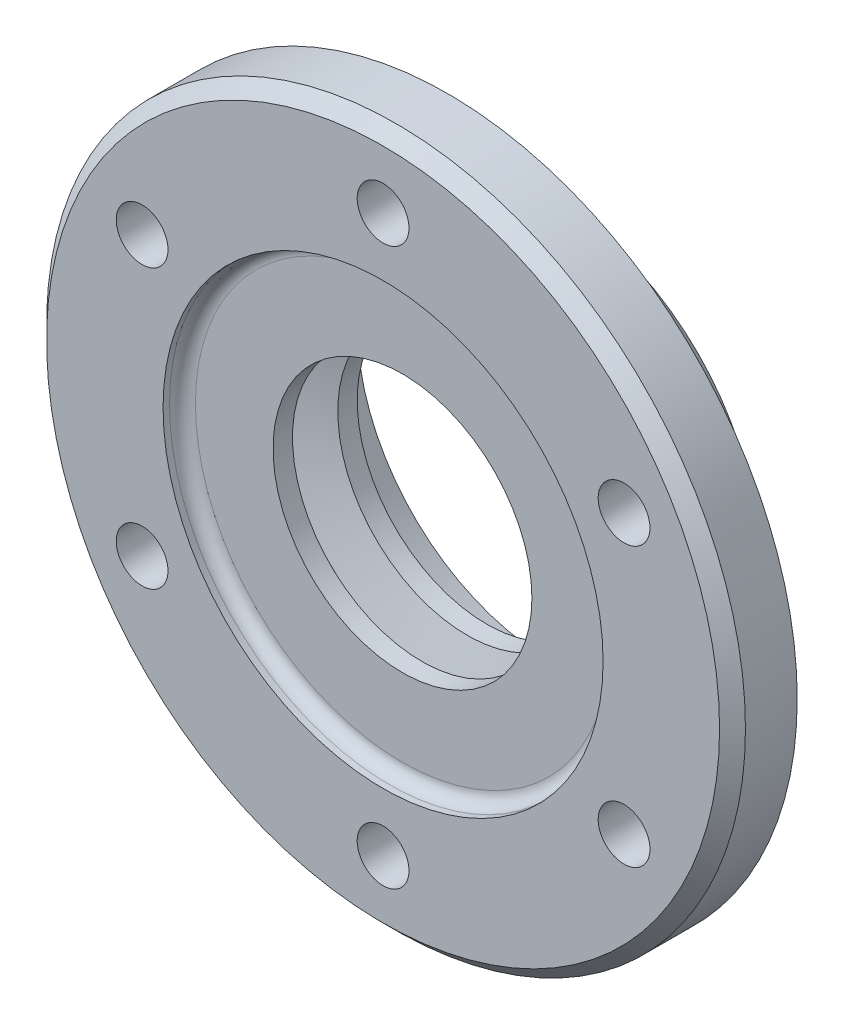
from build123d import *

# Parameters (mm, degrees)
SKETCH_1_R          = 27
EXTRUDE_1_DEPTH     = 5
SKETCH_2_R          = 16
EXTRUDE_2_DEPTH     = 2
SKETCH_4_R          = 17
EXTRUDE_3_DEPTH     = 6
CHAMFER_1_SIZE      = 1
FILLET_1_R          = 1
SKETCH_6_R          = 2
CUT_EXTRUDE_1_DEPTH = 41.33608806


with BuildPart() as part:
    # Sketch 1 → Extrude 1 (new body)
    with BuildSketch(Plane.XY):
        Circle(SKETCH_1_R)
    extrude(amount=EXTRUDE_1_DEPTH)

    # Sketch 2 → Extrude 2 (add)
    with BuildSketch(Plane(origin=(0, 0, 0), x_dir=(-1, 0, 0), z_dir=(0, 0, -1))):
        with Locations(Location((0, 0, 0), (0, 0, 180))):
            Circle(SKETCH_2_R)
    extrude(amount=EXTRUDE_2_DEPTH)

    # Sketch 4 → Extrude 3 (add)
    with BuildSketch(Plane(origin=(0, 0, -2), x_dir=(-1, 0, 0), z_dir=(0, 0, -1))):
        Circle(SKETCH_4_R)
    extrude(amount=EXTRUDE_3_DEPTH)

    # Sketch 5 → Cut-Revolve 1 (revolve, cut)
    with BuildSketch(Plane(origin=(0, 0, 0), x_dir=(0, 0, -1), z_dir=(1, 0, 0)), mode=Mode.PRIVATE) as cut_revolve_1_sk:
        Polygon((-5, 0), (-5, 17), (-3.5, 17), (-3.5, 10), (-2, 10), (-1, 13.527249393), (0.5, 13.527249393), (1.5, 10), (3, 10), (3, 14), (8, 15), (8, 0), align=None)
    revolve(cut_revolve_1_sk.sketch.rotate(Axis((0, 0, 6.851818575), (0, 0, -1)), 90), axis=Axis((0, 0, 6.851818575), (0, 0, -1)), mode=Mode.SUBTRACT)

    # Chamfer 1
    chamfer_1_edges = [part.edges().sort_by_distance(p)[0] for p in [
        (17, 0, -8),
        (-27, 0, 5),
    ]]
    chamfer(chamfer_1_edges, length=CHAMFER_1_SIZE)

    # Fillet 1
    fillet_1_edges = [part.edges().sort_by_distance(p)[0] for p in [
        (-14, 0, -3),
        (-17, 0, 3.5),
    ]]
    fillet(fillet_1_edges, radius=FILLET_1_R)

    # Sketch 6 → Cut-Extrude 1 (cut, through all)
    with BuildSketch(Plane.XY.offset(5)):
        with Locations((0, -21.5)):
            Circle(SKETCH_6_R)
        with Locations((-18.619546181, -10.75)):
            Circle(SKETCH_6_R)
        with Locations((-18.619546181, 10.75)):
            Circle(SKETCH_6_R)
        with Locations((0, 21.5)):
            Circle(SKETCH_6_R)
        with Locations((18.619546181, 10.75)):
            Circle(SKETCH_6_R)
        with Locations((18.619546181, -10.75)):
            Circle(SKETCH_6_R)
    extrude(amount=-CUT_EXTRUDE_1_DEPTH, mode=Mode.SUBTRACT)


solid = part.part
